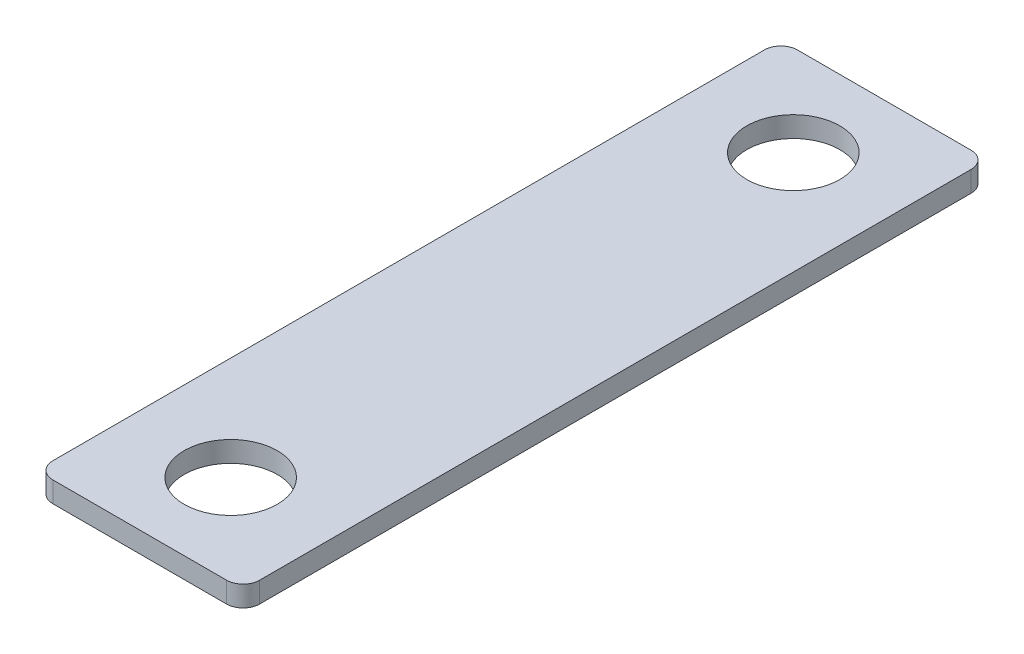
ISO-10303-21;
HEADER;
FILE_DESCRIPTION(('STEP AP214'),'2;1');
FILE_NAME('part.step','',(''),(''),'','','');
FILE_SCHEMA(('AUTOMOTIVE_DESIGN { 1 0 10303 214 1 1 1 1 }'));
ENDSEC;
DATA;
#1=APPLICATION_CONTEXT('core data for automotive mechanical design processes');
#2=APPLICATION_PROTOCOL_DEFINITION('international standard','automotive_design',2000,#1);
#3=PRODUCT_CONTEXT('',#1,'mechanical');
#4=PRODUCT('Part','Part','',(#3));
#5=PRODUCT_RELATED_PRODUCT_CATEGORY('part','',(#4));
#6=PRODUCT_DEFINITION_FORMATION('','',#4);
#7=PRODUCT_DEFINITION_CONTEXT('part definition',#1,'design');
#8=PRODUCT_DEFINITION('design','',#6,#7);
#9=PRODUCT_DEFINITION_SHAPE('','',#8);
#10=(LENGTH_UNIT() NAMED_UNIT(*) SI_UNIT(.MILLI.,.METRE.));
#11=(NAMED_UNIT(*) PLANE_ANGLE_UNIT() SI_UNIT($,.RADIAN.));
#12=(NAMED_UNIT(*) SI_UNIT($,.STERADIAN.) SOLID_ANGLE_UNIT());
#13=UNCERTAINTY_MEASURE_WITH_UNIT(LENGTH_MEASURE(1.E-05),#10,'distance_accuracy_value','');
#14=(GEOMETRIC_REPRESENTATION_CONTEXT(3) GLOBAL_UNCERTAINTY_ASSIGNED_CONTEXT((#13)) GLOBAL_UNIT_ASSIGNED_CONTEXT((#10,
#11,#12)) REPRESENTATION_CONTEXT('',''));
#15=CARTESIAN_POINT('',(0.,0.,0.));
#16=DIRECTION('',(0.,0.,1.));
#17=DIRECTION('',(1.,0.,0.));
#18=AXIS2_PLACEMENT_3D('',#15,#16,#17);
#19=CARTESIAN_POINT('',(0.,3.175,0.));
#20=DIRECTION('',(0.,1.,0.));
#21=DIRECTION('',(0.,0.,1.));
#22=AXIS2_PLACEMENT_3D('',#19,#20,#21);
#23=PLANE('',#22);
#24=CARTESIAN_POINT('',(0.,3.175,-43.18));
#25=DIRECTION('',(0.,1.,0.));
#26=DIRECTION('',(0.,0.,1.));
#27=AXIS2_PLACEMENT_3D('',#24,#25,#26);
#28=CIRCLE('',#27,7.14375);
#29=CARTESIAN_POINT('',(0.,3.175,-36.03625));
#30=VERTEX_POINT('',#29);
#31=EDGE_CURVE('E129',#30,#30,#28,.T.);
#32=ORIENTED_EDGE('',*,*,#31,.F.);
#33=EDGE_LOOP('',(#32));
#34=FACE_BOUND('',#33,.T.);
#35=DIRECTION('',(-1.,0.,0.));
#36=VECTOR('',#35,1.);
#37=CARTESIAN_POINT('',(-15.875,3.175,-57.15));
#38=LINE('',#37,#36);
#39=CARTESIAN_POINT('',(13.335,3.175,-57.15));
#40=VERTEX_POINT('',#39);
#41=CARTESIAN_POINT('',(-13.335,3.175,-57.15));
#42=VERTEX_POINT('',#41);
#43=EDGE_CURVE('E138',#40,#42,#38,.T.);
#44=ORIENTED_EDGE('',*,*,#43,.T.);
#45=CARTESIAN_POINT('',(-13.335,3.175,-54.61));
#46=DIRECTION('',(0.,1.,0.));
#47=DIRECTION('',(0.,0.,1.));
#48=AXIS2_PLACEMENT_3D('',#45,#46,#47);
#49=CIRCLE('',#48,2.54);
#50=CARTESIAN_POINT('',(-15.875,3.175,-54.61));
#51=VERTEX_POINT('',#50);
#52=EDGE_CURVE('E156',#42,#51,#49,.T.);
#53=ORIENTED_EDGE('',*,*,#52,.T.);
#54=DIRECTION('',(0.,0.,1.));
#55=VECTOR('',#54,1.);
#56=CARTESIAN_POINT('',(-15.875,3.175,-57.15));
#57=LINE('',#56,#55);
#58=CARTESIAN_POINT('',(-15.875,3.175,54.61));
#59=VERTEX_POINT('',#58);
#60=EDGE_CURVE('E120',#51,#59,#57,.T.);
#61=ORIENTED_EDGE('',*,*,#60,.T.);
#62=CARTESIAN_POINT('',(-13.335,3.175,54.61));
#63=DIRECTION('',(0.,1.,0.));
#64=DIRECTION('',(0.,0.,1.));
#65=AXIS2_PLACEMENT_3D('',#62,#63,#64);
#66=CIRCLE('',#65,2.54);
#67=CARTESIAN_POINT('',(-13.335,3.175,57.15));
#68=VERTEX_POINT('',#67);
#69=EDGE_CURVE('E152',#59,#68,#66,.T.);
#70=ORIENTED_EDGE('',*,*,#69,.T.);
#71=DIRECTION('',(1.,0.,0.));
#72=VECTOR('',#71,1.);
#73=CARTESIAN_POINT('',(-15.875,3.175,57.15));
#74=LINE('',#73,#72);
#75=CARTESIAN_POINT('',(13.335,3.175,57.15));
#76=VERTEX_POINT('',#75);
#77=EDGE_CURVE('E165',#68,#76,#74,.T.);
#78=ORIENTED_EDGE('',*,*,#77,.T.);
#79=CARTESIAN_POINT('',(13.335,3.175,54.61));
#80=DIRECTION('',(0.,1.,0.));
#81=DIRECTION('',(0.,0.,1.));
#82=AXIS2_PLACEMENT_3D('',#79,#80,#81);
#83=CIRCLE('',#82,2.54);
#84=CARTESIAN_POINT('',(15.875,3.175,54.61));
#85=VERTEX_POINT('',#84);
#86=EDGE_CURVE('E55',#76,#85,#83,.T.);
#87=ORIENTED_EDGE('',*,*,#86,.T.);
#88=DIRECTION('',(0.,0.,-1.));
#89=VECTOR('',#88,1.);
#90=CARTESIAN_POINT('',(15.875,3.175,-57.15));
#91=LINE('',#90,#89);
#92=CARTESIAN_POINT('',(15.875,3.175,-54.61));
#93=VERTEX_POINT('',#92);
#94=EDGE_CURVE('E171',#85,#93,#91,.T.);
#95=ORIENTED_EDGE('',*,*,#94,.T.);
#96=CARTESIAN_POINT('',(13.335,3.175,-54.61));
#97=DIRECTION('',(0.,1.,0.));
#98=DIRECTION('',(0.,0.,1.));
#99=AXIS2_PLACEMENT_3D('',#96,#97,#98);
#100=CIRCLE('',#99,2.54);
#101=EDGE_CURVE('E154',#93,#40,#100,.T.);
#102=ORIENTED_EDGE('',*,*,#101,.T.);
#103=EDGE_LOOP('',(#44,#53,#61,#70,#78,#87,#95,#102));
#104=FACE_BOUND('',#103,.T.);
#105=CARTESIAN_POINT('',(0.,3.175,43.18));
#106=DIRECTION('',(0.,1.,0.));
#107=DIRECTION('',(0.,0.,1.));
#108=AXIS2_PLACEMENT_3D('',#105,#106,#107);
#109=CIRCLE('',#108,7.14375);
#110=CARTESIAN_POINT('',(0.,3.175,50.32375));
#111=VERTEX_POINT('',#110);
#112=EDGE_CURVE('E186',#111,#111,#109,.T.);
#113=ORIENTED_EDGE('',*,*,#112,.F.);
#114=EDGE_LOOP('',(#113));
#115=FACE_BOUND('',#114,.T.);
#116=ADVANCED_FACE('F33',(#34,#104,#115),#23,.T.);
#117=CARTESIAN_POINT('',(0.,0.,0.));
#118=DIRECTION('',(0.,1.,0.));
#119=DIRECTION('',(0.,0.,1.));
#120=AXIS2_PLACEMENT_3D('',#117,#118,#119);
#121=PLANE('',#120);
#122=DIRECTION('',(0.,0.,1.));
#123=VECTOR('',#122,1.);
#124=CARTESIAN_POINT('',(-15.875,0.,-57.15));
#125=LINE('',#124,#123);
#126=CARTESIAN_POINT('',(-15.875,0.,-54.61));
#127=VERTEX_POINT('',#126);
#128=CARTESIAN_POINT('',(-15.875,0.,54.61));
#129=VERTEX_POINT('',#128);
#130=EDGE_CURVE('E117',#127,#129,#125,.T.);
#131=ORIENTED_EDGE('',*,*,#130,.F.);
#132=CARTESIAN_POINT('',(-13.335,0.,-54.61));
#133=DIRECTION('',(0.,1.,0.));
#134=DIRECTION('',(0.,0.,1.));
#135=AXIS2_PLACEMENT_3D('',#132,#133,#134);
#136=CIRCLE('',#135,2.54);
#137=CARTESIAN_POINT('',(-13.335,0.,-57.15));
#138=VERTEX_POINT('',#137);
#139=EDGE_CURVE('E100',#127,#138,#136,.F.);
#140=ORIENTED_EDGE('',*,*,#139,.T.);
#141=DIRECTION('',(-1.,0.,0.));
#142=VECTOR('',#141,1.);
#143=CARTESIAN_POINT('',(-15.875,0.,-57.15));
#144=LINE('',#143,#142);
#145=CARTESIAN_POINT('',(13.335,0.,-57.15));
#146=VERTEX_POINT('',#145);
#147=EDGE_CURVE('E142',#146,#138,#144,.T.);
#148=ORIENTED_EDGE('',*,*,#147,.F.);
#149=CARTESIAN_POINT('',(13.335,0.,-54.61));
#150=DIRECTION('',(0.,1.,0.));
#151=DIRECTION('',(0.,0.,1.));
#152=AXIS2_PLACEMENT_3D('',#149,#150,#151);
#153=CIRCLE('',#152,2.54);
#154=CARTESIAN_POINT('',(15.875,0.,-54.61));
#155=VERTEX_POINT('',#154);
#156=EDGE_CURVE('E111',#146,#155,#153,.F.);
#157=ORIENTED_EDGE('',*,*,#156,.T.);
#158=DIRECTION('',(0.,0.,-1.));
#159=VECTOR('',#158,1.);
#160=CARTESIAN_POINT('',(15.875,0.,-57.15));
#161=LINE('',#160,#159);
#162=CARTESIAN_POINT('',(15.875,0.,54.61));
#163=VERTEX_POINT('',#162);
#164=EDGE_CURVE('E132',#163,#155,#161,.T.);
#165=ORIENTED_EDGE('',*,*,#164,.F.);
#166=CARTESIAN_POINT('',(13.335,0.,54.61));
#167=DIRECTION('',(0.,1.,0.));
#168=DIRECTION('',(0.,0.,1.));
#169=AXIS2_PLACEMENT_3D('',#166,#167,#168);
#170=CIRCLE('',#169,2.54);
#171=CARTESIAN_POINT('',(13.335,0.,57.15));
#172=VERTEX_POINT('',#171);
#173=EDGE_CURVE('E121',#163,#172,#170,.F.);
#174=ORIENTED_EDGE('',*,*,#173,.T.);
#175=DIRECTION('',(1.,0.,0.));
#176=VECTOR('',#175,1.);
#177=CARTESIAN_POINT('',(-15.875,0.,57.15));
#178=LINE('',#177,#176);
#179=CARTESIAN_POINT('',(-13.335,0.,57.15));
#180=VERTEX_POINT('',#179);
#181=EDGE_CURVE('E128',#180,#172,#178,.T.);
#182=ORIENTED_EDGE('',*,*,#181,.F.);
#183=CARTESIAN_POINT('',(-13.335,0.,54.61));
#184=DIRECTION('',(0.,1.,0.));
#185=DIRECTION('',(0.,0.,1.));
#186=AXIS2_PLACEMENT_3D('',#183,#184,#185);
#187=CIRCLE('',#186,2.54);
#188=EDGE_CURVE('E127',#180,#129,#187,.F.);
#189=ORIENTED_EDGE('',*,*,#188,.T.);
#190=EDGE_LOOP('',(#131,#140,#148,#157,#165,#174,#182,#189));
#191=FACE_BOUND('',#190,.T.);
#192=CARTESIAN_POINT('',(0.,0.,-43.18));
#193=DIRECTION('',(0.,1.,0.));
#194=DIRECTION('',(0.,0.,1.));
#195=AXIS2_PLACEMENT_3D('',#192,#193,#194);
#196=CIRCLE('',#195,7.14375);
#197=CARTESIAN_POINT('',(0.,0.,-36.03625));
#198=VERTEX_POINT('',#197);
#199=EDGE_CURVE('E135',#198,#198,#196,.T.);
#200=ORIENTED_EDGE('',*,*,#199,.T.);
#201=EDGE_LOOP('',(#200));
#202=FACE_BOUND('',#201,.T.);
#203=CARTESIAN_POINT('',(0.,0.,43.18));
#204=DIRECTION('',(0.,1.,0.));
#205=DIRECTION('',(0.,0.,1.));
#206=AXIS2_PLACEMENT_3D('',#203,#204,#205);
#207=CIRCLE('',#206,7.14375);
#208=CARTESIAN_POINT('',(0.,0.,50.32375));
#209=VERTEX_POINT('',#208);
#210=EDGE_CURVE('E188',#209,#209,#207,.T.);
#211=ORIENTED_EDGE('',*,*,#210,.T.);
#212=EDGE_LOOP('',(#211));
#213=FACE_BOUND('',#212,.T.);
#214=ADVANCED_FACE('F124',(#191,#202,#213),#121,.F.);
#215=CARTESIAN_POINT('',(-15.875,3.175,-57.15));
#216=DIRECTION('',(1.,0.,0.));
#217=DIRECTION('',(0.,0.,-1.));
#218=AXIS2_PLACEMENT_3D('',#215,#216,#217);
#219=PLANE('',#218);
#220=ORIENTED_EDGE('',*,*,#60,.F.);
#221=DIRECTION('',(0.,-1.,0.));
#222=VECTOR('',#221,1.);
#223=CARTESIAN_POINT('',(-15.875,3.175,-54.61));
#224=LINE('',#223,#222);
#225=EDGE_CURVE('E104',#51,#127,#224,.T.);
#226=ORIENTED_EDGE('',*,*,#225,.T.);
#227=ORIENTED_EDGE('',*,*,#130,.T.);
#228=DIRECTION('',(0.,-1.,0.));
#229=VECTOR('',#228,1.);
#230=CARTESIAN_POINT('',(-15.875,3.175,54.61));
#231=LINE('',#230,#229);
#232=EDGE_CURVE('E122',#129,#59,#231,.F.);
#233=ORIENTED_EDGE('',*,*,#232,.T.);
#234=EDGE_LOOP('',(#220,#226,#227,#233));
#235=FACE_BOUND('',#234,.T.);
#236=ADVANCED_FACE('F116',(#235),#219,.F.);
#237=CARTESIAN_POINT('',(-15.875,3.175,57.15));
#238=DIRECTION('',(0.,0.,-1.));
#239=DIRECTION('',(-1.,0.,0.));
#240=AXIS2_PLACEMENT_3D('',#237,#238,#239);
#241=PLANE('',#240);
#242=ORIENTED_EDGE('',*,*,#77,.F.);
#243=DIRECTION('',(0.,-1.,0.));
#244=VECTOR('',#243,1.);
#245=CARTESIAN_POINT('',(-13.335,3.175,57.15));
#246=LINE('',#245,#244);
#247=EDGE_CURVE('E11',#68,#180,#246,.T.);
#248=ORIENTED_EDGE('',*,*,#247,.T.);
#249=ORIENTED_EDGE('',*,*,#181,.T.);
#250=DIRECTION('',(0.,-1.,0.));
#251=VECTOR('',#250,1.);
#252=CARTESIAN_POINT('',(13.335,3.175,57.15));
#253=LINE('',#252,#251);
#254=EDGE_CURVE('E41',#172,#76,#253,.F.);
#255=ORIENTED_EDGE('',*,*,#254,.T.);
#256=EDGE_LOOP('',(#242,#248,#249,#255));
#257=FACE_BOUND('',#256,.T.);
#258=ADVANCED_FACE('F164',(#257),#241,.F.);
#259=CARTESIAN_POINT('',(15.875,3.175,-57.15));
#260=DIRECTION('',(-1.,0.,0.));
#261=DIRECTION('',(0.,0.,1.));
#262=AXIS2_PLACEMENT_3D('',#259,#260,#261);
#263=PLANE('',#262);
#264=ORIENTED_EDGE('',*,*,#164,.T.);
#265=DIRECTION('',(0.,-1.,0.));
#266=VECTOR('',#265,1.);
#267=CARTESIAN_POINT('',(15.875,3.175,-54.61));
#268=LINE('',#267,#266);
#269=EDGE_CURVE('E48',#155,#93,#268,.F.);
#270=ORIENTED_EDGE('',*,*,#269,.T.);
#271=ORIENTED_EDGE('',*,*,#94,.F.);
#272=DIRECTION('',(0.,-1.,0.));
#273=VECTOR('',#272,1.);
#274=CARTESIAN_POINT('',(15.875,3.175,54.61));
#275=LINE('',#274,#273);
#276=EDGE_CURVE('E158',#85,#163,#275,.T.);
#277=ORIENTED_EDGE('',*,*,#276,.T.);
#278=EDGE_LOOP('',(#264,#270,#271,#277));
#279=FACE_BOUND('',#278,.T.);
#280=ADVANCED_FACE('F175',(#279),#263,.F.);
#281=CARTESIAN_POINT('',(-15.875,3.175,-57.15));
#282=DIRECTION('',(0.,0.,1.));
#283=DIRECTION('',(1.,0.,0.));
#284=AXIS2_PLACEMENT_3D('',#281,#282,#283);
#285=PLANE('',#284);
#286=ORIENTED_EDGE('',*,*,#147,.T.);
#287=DIRECTION('',(0.,-1.,0.));
#288=VECTOR('',#287,1.);
#289=CARTESIAN_POINT('',(-13.335,3.175,-57.15));
#290=LINE('',#289,#288);
#291=EDGE_CURVE('E105',#138,#42,#290,.F.);
#292=ORIENTED_EDGE('',*,*,#291,.T.);
#293=ORIENTED_EDGE('',*,*,#43,.F.);
#294=DIRECTION('',(0.,-1.,0.));
#295=VECTOR('',#294,1.);
#296=CARTESIAN_POINT('',(13.335,3.175,-57.15));
#297=LINE('',#296,#295);
#298=EDGE_CURVE('E110',#40,#146,#297,.T.);
#299=ORIENTED_EDGE('',*,*,#298,.T.);
#300=EDGE_LOOP('',(#286,#292,#293,#299));
#301=FACE_BOUND('',#300,.T.);
#302=ADVANCED_FACE('F182',(#301),#285,.F.);
#303=CARTESIAN_POINT('',(0.,3.175,-43.18));
#304=DIRECTION('',(0.,-1.,0.));
#305=DIRECTION('',(0.,0.,-1.));
#306=AXIS2_PLACEMENT_3D('',#303,#304,#305);
#307=CYLINDRICAL_SURFACE('',#306,7.14375);
#308=ORIENTED_EDGE('',*,*,#31,.T.);
#309=EDGE_LOOP('',(#308));
#310=FACE_BOUND('',#309,.T.);
#311=ORIENTED_EDGE('',*,*,#199,.F.);
#312=EDGE_LOOP('',(#311));
#313=FACE_BOUND('',#312,.T.);
#314=ADVANCED_FACE('F205',(#310,#313),#307,.F.);
#315=CARTESIAN_POINT('',(0.,3.175,43.18));
#316=DIRECTION('',(0.,-1.,0.));
#317=DIRECTION('',(0.,0.,-1.));
#318=AXIS2_PLACEMENT_3D('',#315,#316,#317);
#319=CYLINDRICAL_SURFACE('',#318,7.14375);
#320=ORIENTED_EDGE('',*,*,#112,.T.);
#321=EDGE_LOOP('',(#320));
#322=FACE_BOUND('',#321,.T.);
#323=ORIENTED_EDGE('',*,*,#210,.F.);
#324=EDGE_LOOP('',(#323));
#325=FACE_BOUND('',#324,.T.);
#326=ADVANCED_FACE('F194',(#322,#325),#319,.F.);
#327=CARTESIAN_POINT('',(-13.335,3.175,-54.61));
#328=DIRECTION('',(0.,-1.,0.));
#329=DIRECTION('',(0.,0.,-1.));
#330=AXIS2_PLACEMENT_3D('',#327,#328,#329);
#331=CYLINDRICAL_SURFACE('',#330,2.54);
#332=ORIENTED_EDGE('',*,*,#52,.F.);
#333=ORIENTED_EDGE('',*,*,#291,.F.);
#334=ORIENTED_EDGE('',*,*,#139,.F.);
#335=ORIENTED_EDGE('',*,*,#225,.F.);
#336=EDGE_LOOP('',(#332,#333,#334,#335));
#337=FACE_BOUND('',#336,.T.);
#338=ADVANCED_FACE('F103',(#337),#331,.T.);
#339=CARTESIAN_POINT('',(13.335,3.175,-54.61));
#340=DIRECTION('',(0.,-1.,0.));
#341=DIRECTION('',(0.,0.,-1.));
#342=AXIS2_PLACEMENT_3D('',#339,#340,#341);
#343=CYLINDRICAL_SURFACE('',#342,2.54);
#344=ORIENTED_EDGE('',*,*,#101,.F.);
#345=ORIENTED_EDGE('',*,*,#269,.F.);
#346=ORIENTED_EDGE('',*,*,#156,.F.);
#347=ORIENTED_EDGE('',*,*,#298,.F.);
#348=EDGE_LOOP('',(#344,#345,#346,#347));
#349=FACE_BOUND('',#348,.T.);
#350=ADVANCED_FACE('F179',(#349),#343,.T.);
#351=CARTESIAN_POINT('',(-13.335,3.175,54.61));
#352=DIRECTION('',(0.,-1.,0.));
#353=DIRECTION('',(0.,0.,-1.));
#354=AXIS2_PLACEMENT_3D('',#351,#352,#353);
#355=CYLINDRICAL_SURFACE('',#354,2.54);
#356=ORIENTED_EDGE('',*,*,#69,.F.);
#357=ORIENTED_EDGE('',*,*,#232,.F.);
#358=ORIENTED_EDGE('',*,*,#188,.F.);
#359=ORIENTED_EDGE('',*,*,#247,.F.);
#360=EDGE_LOOP('',(#356,#357,#358,#359));
#361=FACE_BOUND('',#360,.T.);
#362=ADVANCED_FACE('F219',(#361),#355,.T.);
#363=CARTESIAN_POINT('',(13.335,3.175,54.61));
#364=DIRECTION('',(0.,-1.,0.));
#365=DIRECTION('',(0.,0.,-1.));
#366=AXIS2_PLACEMENT_3D('',#363,#364,#365);
#367=CYLINDRICAL_SURFACE('',#366,2.54);
#368=ORIENTED_EDGE('',*,*,#86,.F.);
#369=ORIENTED_EDGE('',*,*,#254,.F.);
#370=ORIENTED_EDGE('',*,*,#173,.F.);
#371=ORIENTED_EDGE('',*,*,#276,.F.);
#372=EDGE_LOOP('',(#368,#369,#370,#371));
#373=FACE_BOUND('',#372,.T.);
#374=ADVANCED_FACE('F35',(#373),#367,.T.);
#375=CLOSED_SHELL('',(#116,#214,#236,#258,#280,#302,#314,#326,#338,#350,#362,#374));
#376=MANIFOLD_SOLID_BREP('B2',#375);
#377=ADVANCED_BREP_SHAPE_REPRESENTATION('',(#18,#376),#14);
#378=SHAPE_DEFINITION_REPRESENTATION(#9,#377);
ENDSEC;
END-ISO-10303-21;
